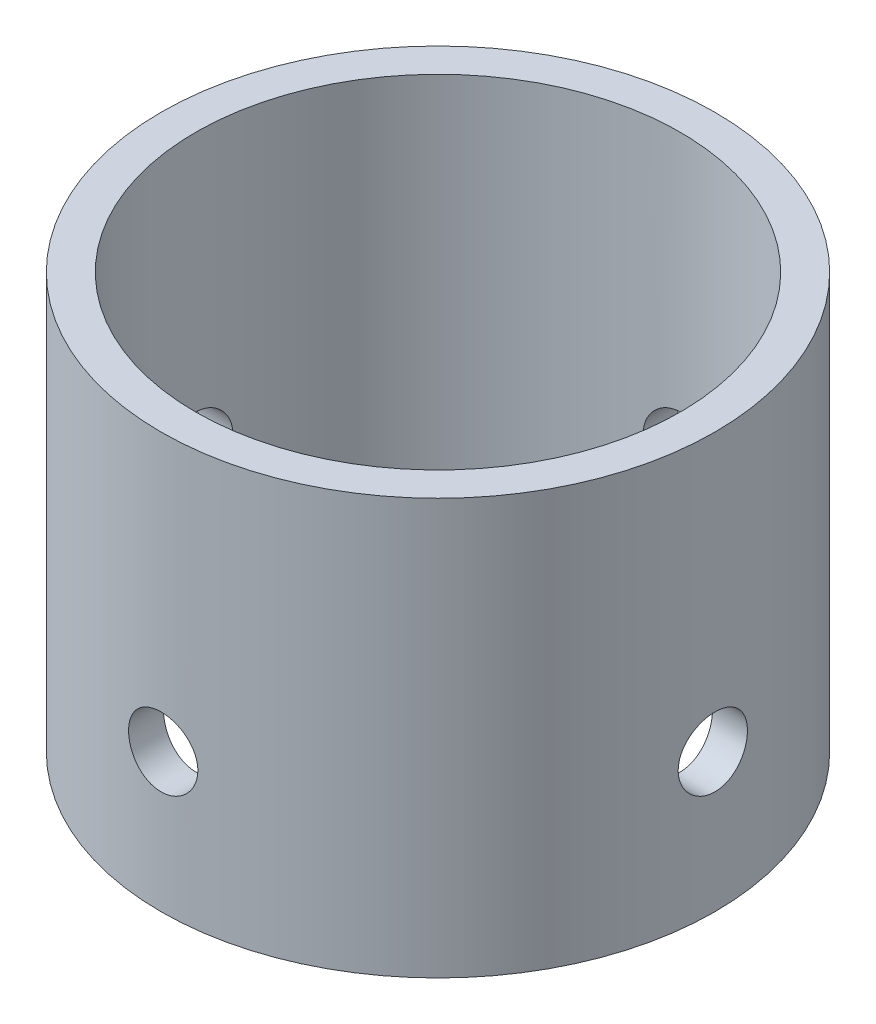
ISO-10303-21;
HEADER;
FILE_DESCRIPTION(('STEP AP214'),'2;1');
FILE_NAME('part.step','',(''),(''),'','','');
FILE_SCHEMA(('AUTOMOTIVE_DESIGN { 1 0 10303 214 1 1 1 1 }'));
ENDSEC;
DATA;
#1=APPLICATION_CONTEXT('core data for automotive mechanical design processes');
#2=APPLICATION_PROTOCOL_DEFINITION('international standard','automotive_design',2000,#1);
#3=PRODUCT_CONTEXT('',#1,'mechanical');
#4=PRODUCT('Part','Part','',(#3));
#5=PRODUCT_RELATED_PRODUCT_CATEGORY('part','',(#4));
#6=PRODUCT_DEFINITION_FORMATION('','',#4);
#7=PRODUCT_DEFINITION_CONTEXT('part definition',#1,'design');
#8=PRODUCT_DEFINITION('design','',#6,#7);
#9=PRODUCT_DEFINITION_SHAPE('','',#8);
#10=(LENGTH_UNIT() NAMED_UNIT(*) SI_UNIT(.MILLI.,.METRE.));
#11=(NAMED_UNIT(*) PLANE_ANGLE_UNIT() SI_UNIT($,.RADIAN.));
#12=(NAMED_UNIT(*) SI_UNIT($,.STERADIAN.) SOLID_ANGLE_UNIT());
#13=UNCERTAINTY_MEASURE_WITH_UNIT(LENGTH_MEASURE(1.E-05),#10,'distance_accuracy_value','');
#14=(GEOMETRIC_REPRESENTATION_CONTEXT(3) GLOBAL_UNCERTAINTY_ASSIGNED_CONTEXT((#13)) GLOBAL_UNIT_ASSIGNED_CONTEXT((#10,
#11,#12)) REPRESENTATION_CONTEXT('',''));
#15=CARTESIAN_POINT('',(0.,0.,0.));
#16=DIRECTION('',(0.,0.,1.));
#17=DIRECTION('',(1.,0.,0.));
#18=AXIS2_PLACEMENT_3D('',#15,#16,#17);
#19=CARTESIAN_POINT('',(0.,19.05,0.));
#20=DIRECTION('',(0.,1.,0.));
#21=DIRECTION('',(0.,0.,1.));
#22=AXIS2_PLACEMENT_3D('',#19,#20,#21);
#23=PLANE('',#22);
#24=CARTESIAN_POINT('',(0.,19.05,0.));
#25=DIRECTION('',(0.,1.,0.));
#26=DIRECTION('',(0.,0.,1.));
#27=AXIS2_PLACEMENT_3D('',#24,#25,#26);
#28=CIRCLE('',#27,12.7);
#29=CARTESIAN_POINT('',(0.,19.05,12.7));
#30=VERTEX_POINT('',#29);
#31=EDGE_CURVE('E10',#30,#30,#28,.T.);
#32=ORIENTED_EDGE('',*,*,#31,.T.);
#33=EDGE_LOOP('',(#32));
#34=FACE_BOUND('',#33,.T.);
#35=CARTESIAN_POINT('',(0.,19.05,0.));
#36=DIRECTION('',(0.,1.,0.));
#37=DIRECTION('',(0.,0.,1.));
#38=AXIS2_PLACEMENT_3D('',#35,#36,#37);
#39=CIRCLE('',#38,11.1125);
#40=CARTESIAN_POINT('',(0.,19.05,11.1125));
#41=VERTEX_POINT('',#40);
#42=EDGE_CURVE('E48',#41,#41,#39,.T.);
#43=ORIENTED_EDGE('',*,*,#42,.F.);
#44=EDGE_LOOP('',(#43));
#45=FACE_BOUND('',#44,.T.);
#46=ADVANCED_FACE('F30',(#34,#45),#23,.T.);
#47=CARTESIAN_POINT('',(0.,0.,0.));
#48=DIRECTION('',(0.,1.,0.));
#49=DIRECTION('',(0.,0.,1.));
#50=AXIS2_PLACEMENT_3D('',#47,#48,#49);
#51=PLANE('',#50);
#52=CARTESIAN_POINT('',(0.,0.,0.));
#53=DIRECTION('',(0.,1.,0.));
#54=DIRECTION('',(0.,0.,1.));
#55=AXIS2_PLACEMENT_3D('',#52,#53,#54);
#56=CIRCLE('',#55,12.7);
#57=CARTESIAN_POINT('',(0.,0.,12.7));
#58=VERTEX_POINT('',#57);
#59=EDGE_CURVE('E43',#58,#58,#56,.T.);
#60=ORIENTED_EDGE('',*,*,#59,.F.);
#61=EDGE_LOOP('',(#60));
#62=FACE_BOUND('',#61,.T.);
#63=CARTESIAN_POINT('',(0.,0.,0.));
#64=DIRECTION('',(0.,1.,0.));
#65=DIRECTION('',(0.,0.,1.));
#66=AXIS2_PLACEMENT_3D('',#63,#64,#65);
#67=CIRCLE('',#66,11.1125);
#68=CARTESIAN_POINT('',(0.,0.,11.1125));
#69=VERTEX_POINT('',#68);
#70=EDGE_CURVE('E51',#69,#69,#67,.T.);
#71=ORIENTED_EDGE('',*,*,#70,.T.);
#72=EDGE_LOOP('',(#71));
#73=FACE_BOUND('',#72,.T.);
#74=ADVANCED_FACE('F98',(#62,#73),#51,.F.);
#75=CARTESIAN_POINT('',(0.,19.05,0.));
#76=DIRECTION('',(0.,-1.,0.));
#77=DIRECTION('',(0.,0.,-1.));
#78=AXIS2_PLACEMENT_3D('',#75,#76,#77);
#79=CYLINDRICAL_SURFACE('',#78,12.7);
#80=CARTESIAN_POINT('',(12.7,4.7625,0.));
#81=CARTESIAN_POINT('',(12.6999987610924,4.76250377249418,0.0887990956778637));
#82=CARTESIAN_POINT('',(12.6990588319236,4.76997577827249,0.177653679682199));
#83=CARTESIAN_POINT('',(12.6953996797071,4.79966512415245,0.352890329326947));
#84=CARTESIAN_POINT('',(12.6926785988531,4.82189786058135,0.439269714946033));
#85=CARTESIAN_POINT('',(12.685763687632,4.88044340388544,0.606993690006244));
#86=CARTESIAN_POINT('',(12.6815708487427,4.91674673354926,0.688341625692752));
#87=CARTESIAN_POINT('',(12.6721787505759,5.00238222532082,0.843774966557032));
#88=CARTESIAN_POINT('',(12.6669796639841,5.051712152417,0.91786161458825));
#89=CARTESIAN_POINT('',(12.6561235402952,5.16229088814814,1.05709263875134));
#90=CARTESIAN_POINT('',(12.6504643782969,5.22359707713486,1.12219128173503));
#91=CARTESIAN_POINT('',(12.6393430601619,5.35626489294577,1.24120452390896));
#92=CARTESIAN_POINT('',(12.6338809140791,5.42762703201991,1.29511855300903));
#93=CARTESIAN_POINT('',(12.6237511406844,5.5786781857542,1.39040245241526));
#94=CARTESIAN_POINT('',(12.6190862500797,5.65839442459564,1.43172948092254));
#95=CARTESIAN_POINT('',(12.6111071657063,5.82370377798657,1.50039265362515));
#96=CARTESIAN_POINT('',(12.6077929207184,5.90929666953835,1.52772932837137));
#97=CARTESIAN_POINT('',(12.6029106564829,6.08345506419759,1.56749685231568));
#98=CARTESIAN_POINT('',(12.6013335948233,6.17200267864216,1.58000491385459));
#99=CARTESIAN_POINT('',(12.6000765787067,6.34995317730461,1.5899990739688));
#100=CARTESIAN_POINT('',(12.6003965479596,6.43935602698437,1.58748577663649));
#101=CARTESIAN_POINT('',(12.6028891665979,6.61594106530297,1.56757194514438));
#102=CARTESIAN_POINT('',(12.6050512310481,6.70313301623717,1.55025646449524));
#103=CARTESIAN_POINT('',(12.6109679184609,6.87336383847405,1.50136249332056));
#104=CARTESIAN_POINT('',(12.6147225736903,6.95640262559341,1.46978371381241));
#105=CARTESIAN_POINT('',(12.6234133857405,7.11623417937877,1.39316813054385));
#106=CARTESIAN_POINT('',(12.6283527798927,7.1930090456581,1.34809436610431));
#107=CARTESIAN_POINT('',(12.6388540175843,7.33793725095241,1.2457947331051));
#108=CARTESIAN_POINT('',(12.644415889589,7.40609019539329,1.18856830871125));
#109=CARTESIAN_POINT('',(12.6555824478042,7.53233362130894,1.06311643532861));
#110=CARTESIAN_POINT('',(12.6611871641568,7.5903512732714,0.994817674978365));
#111=CARTESIAN_POINT('',(12.6717719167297,7.6941101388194,0.849412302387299));
#112=CARTESIAN_POINT('',(12.6767519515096,7.73985132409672,0.772305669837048));
#113=CARTESIAN_POINT('',(12.685529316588,7.81775888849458,0.611417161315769));
#114=CARTESIAN_POINT('',(12.6893262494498,7.84992070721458,0.527633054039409));
#115=CARTESIAN_POINT('',(12.6953059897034,7.89969876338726,0.355795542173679));
#116=CARTESIAN_POINT('',(12.6974888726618,7.91731568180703,0.267742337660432));
#117=CARTESIAN_POINT('',(12.6999847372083,7.93740946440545,0.0904958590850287));
#118=CARTESIAN_POINT('',(12.7003101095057,7.93998665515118,0.00131412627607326));
#119=CARTESIAN_POINT('',(12.6990877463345,7.93019258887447,-0.176209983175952));
#120=CARTESIAN_POINT('',(12.6975400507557,7.91782165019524,-0.264552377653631));
#121=CARTESIAN_POINT('',(12.692753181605,7.87856583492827,-0.437594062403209));
#122=CARTESIAN_POINT('',(12.6895195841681,7.85172879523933,-0.52230437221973));
#123=CARTESIAN_POINT('',(12.6817229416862,7.7843523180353,-0.68602203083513));
#124=CARTESIAN_POINT('',(12.677159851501,7.74381241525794,-0.765029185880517));
#125=CARTESIAN_POINT('',(12.6671820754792,7.64993825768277,-0.915545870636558));
#126=CARTESIAN_POINT('',(12.6617631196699,7.59653910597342,-0.987014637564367));
#127=CARTESIAN_POINT('',(12.6506931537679,7.47855406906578,-1.12001108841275));
#128=CARTESIAN_POINT('',(12.6450421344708,7.41396773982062,-1.18153837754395));
#129=CARTESIAN_POINT('',(12.6341067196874,7.27499979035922,-1.29326129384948));
#130=CARTESIAN_POINT('',(12.6288245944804,7.2005645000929,-1.34339041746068));
#131=CARTESIAN_POINT('',(12.6192623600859,7.04427201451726,-1.43043458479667));
#132=CARTESIAN_POINT('',(12.614982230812,6.96241496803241,-1.46734989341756));
#133=CARTESIAN_POINT('',(12.6079240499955,6.79381717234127,-1.5268108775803));
#134=CARTESIAN_POINT('',(12.6051420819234,6.70708981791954,-1.54939404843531));
#135=CARTESIAN_POINT('',(12.6013839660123,6.53103692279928,-1.57967044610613));
#136=CARTESIAN_POINT('',(12.6004077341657,6.44171150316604,-1.58736436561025));
#137=CARTESIAN_POINT('',(12.6003740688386,6.26365972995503,-1.58763115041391));
#138=CARTESIAN_POINT('',(12.6013033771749,6.17493351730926,-1.58030849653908));
#139=CARTESIAN_POINT('',(12.6049475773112,5.99998347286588,-1.55097124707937));
#140=CARTESIAN_POINT('',(12.6076624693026,5.91375964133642,-1.52895664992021));
#141=CARTESIAN_POINT('',(12.6145678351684,5.74627568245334,-1.47089309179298));
#142=CARTESIAN_POINT('',(12.6187577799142,5.66501378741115,-1.43484916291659));
#143=CARTESIAN_POINT('',(12.6281420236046,5.50967487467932,-1.34976038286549));
#144=CARTESIAN_POINT('',(12.6333363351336,5.43559794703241,-1.30071536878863));
#145=CARTESIAN_POINT('',(12.6441873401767,5.2961976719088,-1.19062902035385));
#146=CARTESIAN_POINT('',(12.6498468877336,5.23093603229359,-1.12950982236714));
#147=CARTESIAN_POINT('',(12.6609654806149,5.11155516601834,-0.997172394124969));
#148=CARTESIAN_POINT('',(12.66642447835,5.05743857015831,-0.925951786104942));
#149=CARTESIAN_POINT('',(12.6765498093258,4.96170879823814,-0.775122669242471));
#150=CARTESIAN_POINT('',(12.6812130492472,4.92014395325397,-0.695483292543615));
#151=CARTESIAN_POINT('',(12.6891900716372,4.85103726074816,-0.53034114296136));
#152=CARTESIAN_POINT('',(12.6925053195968,4.82348017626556,-0.444844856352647));
#153=CARTESIAN_POINT('',(12.6966136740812,4.78976732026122,-0.299088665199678));
#154=CARTESIAN_POINT('',(12.6978773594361,4.77955677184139,-0.23974784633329));
#155=CARTESIAN_POINT('',(12.6995709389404,4.7659218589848,-0.120279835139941));
#156=CARTESIAN_POINT('',(12.7000008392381,4.76249744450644,-0.0601526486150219));
#157=CARTESIAN_POINT('',(12.7,4.7625,0.));
#158=B_SPLINE_CURVE_WITH_KNOTS('',3,(#80,#81,#82,#83,#84,#85,#86,#87,#88,#89,#90,#91,#92,#93,
#94,#95,#96,#97,#98,#99,#100,#101,#102,#103,#104,#105,#106,#107,#108,#109,#110,#111,#112,#113,
#114,#115,#116,#117,#118,#119,#120,#121,#122,#123,#124,#125,#126,#127,#128,#129,#130,#131,#132,
#133,#134,#135,#136,#137,#138,#139,#140,#141,#142,#143,#144,#145,#146,#147,#148,#149,#150,#151,
#152,#153,#154,#155,#156,#157),.UNSPECIFIED.,.T.,.F.,(4,2,2,2,2,2,2,2,2,2,2,2,2,2,2,2,2,2,2,2,2,
2,2,2,2,2,2,2,2,2,2,2,2,2,2,2,2,2,4),(0.,0.266177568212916,0.532633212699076,0.798909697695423,
1.06514052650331,1.3326796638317,1.60023243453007,1.86868593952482,2.13712926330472,
2.40416858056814,2.67119715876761,2.93670162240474,3.20221146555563,3.46845525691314,
3.7347112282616,4.00280808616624,4.27090556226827,4.53909300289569,4.807267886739,
5.0736517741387,5.34002998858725,5.60553269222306,5.87104441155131,6.13792525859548,
6.40481670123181,6.67322751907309,6.94163295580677,7.20933327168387,7.47702113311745,
7.74285282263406,8.00868454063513,8.27442099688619,8.54016078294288,8.80767375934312,
9.07524981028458,9.34384340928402,9.61214421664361,9.79245465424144,9.97276376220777),.UNSPECIFIED.);
#159=CARTESIAN_POINT('',(12.7,4.7625,0.));
#160=VERTEX_POINT('',#159);
#161=EDGE_CURVE('E61',#160,#160,#158,.T.);
#162=ORIENTED_EDGE('',*,*,#161,.T.);
#163=EDGE_LOOP('',(#162));
#164=FACE_BOUND('',#163,.T.);
#165=CARTESIAN_POINT('',(-12.6003906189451,6.35,1.58750000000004));
#166=CARTESIAN_POINT('',(-12.6003918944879,6.26120395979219,1.5874962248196));
#167=CARTESIAN_POINT('',(-12.6013393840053,6.17235242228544,1.58002471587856));
#168=CARTESIAN_POINT('',(-12.6050255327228,5.99712210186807,1.5503375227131));
#169=CARTESIAN_POINT('',(-12.6077660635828,5.91074600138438,1.52810643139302));
#170=CARTESIAN_POINT('',(-12.614723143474,5.74302897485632,1.46956569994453));
#171=CARTESIAN_POINT('',(-12.6189386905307,5.66168467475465,1.43326561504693));
#172=CARTESIAN_POINT('',(-12.6283696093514,5.50625743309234,1.3476377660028));
#173=CARTESIAN_POINT('',(-12.6335848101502,5.43217325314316,1.29831222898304));
#174=CARTESIAN_POINT('',(-12.6444601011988,5.29293947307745,1.18773794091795));
#175=CARTESIAN_POINT('',(-12.650122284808,5.22783638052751,1.12643082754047));
#176=CARTESIAN_POINT('',(-12.6612347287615,5.10881454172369,0.993759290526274));
#177=CARTESIAN_POINT('',(-12.6666849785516,5.05489635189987,0.922394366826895));
#178=CARTESIAN_POINT('',(-12.6767808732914,4.95960807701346,0.771340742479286));
#179=CARTESIAN_POINT('',(-12.6814237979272,4.91828007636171,0.691625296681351));
#180=CARTESIAN_POINT('',(-12.6893589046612,4.84961488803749,0.526317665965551));
#181=CARTESIAN_POINT('',(-12.6926511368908,4.82227718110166,0.440725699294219));
#182=CARTESIAN_POINT('',(-12.6974991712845,4.78250753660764,0.266570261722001));
#183=CARTESIAN_POINT('',(-12.6990639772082,4.76999828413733,0.17802470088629));
#184=CARTESIAN_POINT('',(-12.7003115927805,4.7600010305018,7.82324360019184E-05));
#185=CARTESIAN_POINT('',(-12.6999944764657,4.76251243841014,-0.0893226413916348));
#186=CARTESIAN_POINT('',(-12.6975212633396,4.78242325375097,-0.265915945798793));
#187=CARTESIAN_POINT('',(-12.6953754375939,4.79973951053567,-0.353117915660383));
#188=CARTESIAN_POINT('',(-12.6894974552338,4.84863849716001,-0.523368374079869));
#189=CARTESIAN_POINT('',(-12.6857652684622,4.88022149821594,-0.606416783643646));
#190=CARTESIAN_POINT('',(-12.6771162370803,4.9568458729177,-0.766260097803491));
#191=CARTESIAN_POINT('',(-12.6721962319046,5.00192323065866,-0.843037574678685));
#192=CARTESIAN_POINT('',(-12.6617220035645,5.10423056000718,-0.987969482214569));
#193=CARTESIAN_POINT('',(-12.6561677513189,5.16146108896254,-1.05612351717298));
#194=CARTESIAN_POINT('',(-12.6450018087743,5.28691590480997,-1.18236239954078));
#195=CARTESIAN_POINT('',(-12.63938998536,5.35521265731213,-1.24037524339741));
#196=CARTESIAN_POINT('',(-12.6287788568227,5.50061228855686,-1.3441253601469));
#197=CARTESIAN_POINT('',(-12.6237795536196,5.57771519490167,-1.38986259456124));
#198=CARTESIAN_POINT('',(-12.6149595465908,5.73860262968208,-1.46776730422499));
#199=CARTESIAN_POINT('',(-12.6111393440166,5.82238998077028,-1.49992901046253));
#200=CARTESIAN_POINT('',(-12.6051198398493,5.99423455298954,-1.54970585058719));
#201=CARTESIAN_POINT('',(-12.6029204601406,6.08229156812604,-1.56732168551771));
#202=CARTESIAN_POINT('',(-12.6004058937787,6.25953992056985,-1.58741137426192));
#203=CARTESIAN_POINT('',(-12.6000780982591,6.34871960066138,-1.58998655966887));
#204=CARTESIAN_POINT('',(-12.6013104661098,6.52623912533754,-1.58018921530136));
#205=CARTESIAN_POINT('',(-12.6028705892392,6.61457898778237,-1.56781700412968));
#206=CARTESIAN_POINT('',(-12.6076915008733,6.78760755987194,-1.52856138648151));
#207=CARTESIAN_POINT('',(-12.6109465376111,6.87230757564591,-1.5017270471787));
#208=CARTESIAN_POINT('',(-12.6187858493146,7.03600583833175,-1.4343594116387));
#209=CARTESIAN_POINT('',(-12.6233701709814,7.11500388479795,-1.39382563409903));
#210=CARTESIAN_POINT('',(-12.633381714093,7.26551419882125,-1.29996058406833));
#211=CARTESIAN_POINT('',(-12.6388132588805,7.33698473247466,-1.24656286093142));
#212=CARTESIAN_POINT('',(-12.649893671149,7.46998541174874,-1.12857962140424));
#213=CARTESIAN_POINT('',(-12.6555425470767,7.53151517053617,-1.06399366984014));
#214=CARTESIAN_POINT('',(-12.6664598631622,7.64324365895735,-0.925024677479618));
#215=CARTESIAN_POINT('',(-12.6717259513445,7.69337580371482,-0.850587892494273));
#216=CARTESIAN_POINT('',(-12.6812491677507,7.78042526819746,-0.694291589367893));
#217=CARTESIAN_POINT('',(-12.685506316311,7.81734285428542,-0.612432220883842));
#218=CARTESIAN_POINT('',(-12.6925215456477,7.8768052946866,-0.44383570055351));
#219=CARTESIAN_POINT('',(-12.6952836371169,7.89938863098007,-0.357112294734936));
#220=CARTESIAN_POINT('',(-12.6990141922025,7.92966669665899,-0.181067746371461));
#221=CARTESIAN_POINT('',(-12.6999827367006,7.93736209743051,-0.0917467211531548));
#222=CARTESIAN_POINT('',(-12.7000166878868,7.93763330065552,0.0863074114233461));
#223=CARTESIAN_POINT('',(-12.6990950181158,7.93031177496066,0.1750403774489));
#224=CARTESIAN_POINT('',(-12.6954777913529,7.90097441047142,0.350004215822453));
#225=CARTESIAN_POINT('',(-12.6927822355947,7.87895858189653,0.436235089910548));
#226=CARTESIAN_POINT('',(-12.6859187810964,7.82088979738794,0.603733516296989));
#227=CARTESIAN_POINT('',(-12.6817513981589,7.784841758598,0.685002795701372));
#228=CARTESIAN_POINT('',(-12.6724057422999,7.6997424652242,0.840354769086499));
#229=CARTESIAN_POINT('',(-12.6672274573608,7.65069105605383,0.914437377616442));
#230=CARTESIAN_POINT('',(-12.6563957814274,7.5405975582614,1.05383759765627));
#231=CARTESIAN_POINT('',(-12.6507395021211,7.47947907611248,1.11909465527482));
#232=CARTESIAN_POINT('',(-12.639612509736,7.34714498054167,1.23846661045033));
#233=CARTESIAN_POINT('',(-12.6341418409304,7.27592697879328,1.29257886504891));
#234=CARTESIAN_POINT('',(-12.6239829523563,7.12510009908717,1.38830382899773));
#235=CARTESIAN_POINT('',(-12.619297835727,7.04545988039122,1.42986746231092));
#236=CARTESIAN_POINT('',(-12.6112768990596,6.88031596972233,1.49897165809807));
#237=CARTESIAN_POINT('',(-12.6079396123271,6.79481877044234,1.52652747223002));
#238=CARTESIAN_POINT('',(-12.603802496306,6.64906595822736,1.56023684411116));
#239=CARTESIAN_POINT('',(-12.6025294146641,6.58972967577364,1.57044582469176));
#240=CARTESIAN_POINT('',(-12.6008230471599,6.470270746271,1.58407865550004));
#241=CARTESIAN_POINT('',(-12.6003897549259,6.41014810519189,1.58750255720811));
#242=CARTESIAN_POINT('',(-12.6003906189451,6.35,1.58750000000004));
#243=B_SPLINE_CURVE_WITH_KNOTS('',3,(#165,#166,#167,#168,#169,#170,#171,#172,#173,#174,#175,
#176,#177,#178,#179,#180,#181,#182,#183,#184,#185,#186,#187,#188,#189,#190,#191,#192,#193,#194,
#195,#196,#197,#198,#199,#200,#201,#202,#203,#204,#205,#206,#207,#208,#209,#210,#211,#212,#213,
#214,#215,#216,#217,#218,#219,#220,#221,#222,#223,#224,#225,#226,#227,#228,#229,#230,#231,#232,
#233,#234,#235,#236,#237,#238,#239,#240,#241,#242),.UNSPECIFIED.,.T.,.F.,(4,2,2,2,2,2,2,2,2,2,2,
2,2,2,2,2,2,2,2,2,2,2,2,2,2,2,2,2,2,2,2,2,2,2,2,2,2,2,4),(0.,0.266168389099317,
0.532615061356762,0.798881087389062,1.06510161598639,1.33265276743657,1.60021722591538,
1.86866648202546,2.13710577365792,2.40413919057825,2.67116210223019,2.93669507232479,
3.20223309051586,3.46848559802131,3.73475031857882,4.00283487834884,4.27092027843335,
4.53911948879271,4.8073057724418,5.07368313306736,5.34005481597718,5.60552838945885,
5.87101129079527,6.13789615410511,6.40479140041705,6.67320792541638,6.94161903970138,
7.20930649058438,7.47698186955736,7.74283323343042,8.00868441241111,8.27444251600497,
8.54020377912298,8.80770481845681,9.07526922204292,9.3438668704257,9.6121714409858,
9.79246828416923,9.97276375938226),.UNSPECIFIED.);
#244=CARTESIAN_POINT('',(-12.6003906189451,6.35,1.58750000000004));
#245=VERTEX_POINT('',#244);
#246=EDGE_CURVE('E157',#245,#245,#243,.T.);
#247=ORIENTED_EDGE('',*,*,#246,.T.);
#248=EDGE_LOOP('',(#247));
#249=FACE_BOUND('',#248,.T.);
#250=CARTESIAN_POINT('',(0.,4.7625,12.7));
#251=CARTESIAN_POINT('',(-0.0887990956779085,4.76250377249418,12.6999987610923));
#252=CARTESIAN_POINT('',(-0.177653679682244,4.76997577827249,12.6990588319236));
#253=CARTESIAN_POINT('',(-0.352890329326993,4.79966512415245,12.6953996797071));
#254=CARTESIAN_POINT('',(-0.439269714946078,4.82189786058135,12.6926785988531));
#255=CARTESIAN_POINT('',(-0.606993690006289,4.88044340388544,12.685763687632));
#256=CARTESIAN_POINT('',(-0.688341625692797,4.91674673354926,12.6815708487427));
#257=CARTESIAN_POINT('',(-0.843774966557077,5.00238222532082,12.6721787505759));
#258=CARTESIAN_POINT('',(-0.917861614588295,5.051712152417,12.6669796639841));
#259=CARTESIAN_POINT('',(-1.05709263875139,5.16229088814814,12.6561235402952));
#260=CARTESIAN_POINT('',(-1.12219128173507,5.22359707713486,12.6504643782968));
#261=CARTESIAN_POINT('',(-1.24120452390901,5.35626489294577,12.6393430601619));
#262=CARTESIAN_POINT('',(-1.29511855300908,5.42762703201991,12.6338809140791));
#263=CARTESIAN_POINT('',(-1.3904024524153,5.5786781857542,12.6237511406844));
#264=CARTESIAN_POINT('',(-1.43172948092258,5.65839442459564,12.6190862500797));
#265=CARTESIAN_POINT('',(-1.5003926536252,5.82370377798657,12.6111071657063));
#266=CARTESIAN_POINT('',(-1.52772932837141,5.90929666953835,12.6077929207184));
#267=CARTESIAN_POINT('',(-1.56749685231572,6.0834550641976,12.6029106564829));
#268=CARTESIAN_POINT('',(-1.58000491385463,6.17200267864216,12.6013335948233));
#269=CARTESIAN_POINT('',(-1.58999907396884,6.34995317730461,12.6000765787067));
#270=CARTESIAN_POINT('',(-1.58748577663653,6.43935602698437,12.6003965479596));
#271=CARTESIAN_POINT('',(-1.56757194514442,6.61594106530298,12.6028891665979));
#272=CARTESIAN_POINT('',(-1.55025646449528,6.70313301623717,12.6050512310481));
#273=CARTESIAN_POINT('',(-1.5013624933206,6.87336383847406,12.6109679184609));
#274=CARTESIAN_POINT('',(-1.46978371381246,6.95640262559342,12.6147225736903));
#275=CARTESIAN_POINT('',(-1.3931681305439,7.11623417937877,12.6234133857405));
#276=CARTESIAN_POINT('',(-1.34809436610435,7.1930090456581,12.6283527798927));
#277=CARTESIAN_POINT('',(-1.24579473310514,7.33793725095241,12.6388540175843));
#278=CARTESIAN_POINT('',(-1.18856830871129,7.40609019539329,12.644415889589));
#279=CARTESIAN_POINT('',(-1.06311643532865,7.53233362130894,12.6555824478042));
#280=CARTESIAN_POINT('',(-0.994817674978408,7.5903512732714,12.6611871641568));
#281=CARTESIAN_POINT('',(-0.849412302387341,7.6941101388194,12.6717719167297));
#282=CARTESIAN_POINT('',(-0.77230566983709,7.73985132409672,12.6767519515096));
#283=CARTESIAN_POINT('',(-0.61141716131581,7.81775888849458,12.685529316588));
#284=CARTESIAN_POINT('',(-0.52763305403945,7.84992070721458,12.6893262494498));
#285=CARTESIAN_POINT('',(-0.355795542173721,7.89969876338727,12.6953059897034));
#286=CARTESIAN_POINT('',(-0.267742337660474,7.91731568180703,12.6974888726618));
#287=CARTESIAN_POINT('',(-0.0904958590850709,7.93740946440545,12.6999847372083));
#288=CARTESIAN_POINT('',(-0.00131412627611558,7.93998665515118,12.7003101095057));
#289=CARTESIAN_POINT('',(0.17620998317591,7.93019258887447,12.6990877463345));
#290=CARTESIAN_POINT('',(0.264552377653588,7.91782165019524,12.6975400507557));
#291=CARTESIAN_POINT('',(0.437594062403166,7.87856583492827,12.692753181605));
#292=CARTESIAN_POINT('',(0.522304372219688,7.85172879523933,12.6895195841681));
#293=CARTESIAN_POINT('',(0.686022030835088,7.7843523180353,12.6817229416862));
#294=CARTESIAN_POINT('',(0.765029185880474,7.74381241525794,12.677159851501));
#295=CARTESIAN_POINT('',(0.915545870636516,7.64993825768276,12.6671820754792));
#296=CARTESIAN_POINT('',(0.987014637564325,7.59653910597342,12.6617631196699));
#297=CARTESIAN_POINT('',(1.12001108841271,7.47855406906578,12.6506931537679));
#298=CARTESIAN_POINT('',(1.1815383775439,7.41396773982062,12.6450421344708));
#299=CARTESIAN_POINT('',(1.29326129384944,7.27499979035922,12.6341067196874));
#300=CARTESIAN_POINT('',(1.34339041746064,7.2005645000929,12.6288245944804));
#301=CARTESIAN_POINT('',(1.43043458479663,7.04427201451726,12.6192623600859));
#302=CARTESIAN_POINT('',(1.46734989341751,6.96241496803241,12.614982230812));
#303=CARTESIAN_POINT('',(1.52681087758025,6.79381717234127,12.6079240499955));
#304=CARTESIAN_POINT('',(1.54939404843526,6.70708981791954,12.6051420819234));
#305=CARTESIAN_POINT('',(1.57967044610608,6.53103692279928,12.6013839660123));
#306=CARTESIAN_POINT('',(1.58736436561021,6.44171150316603,12.6004077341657));
#307=CARTESIAN_POINT('',(1.58763115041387,6.26365972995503,12.6003740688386));
#308=CARTESIAN_POINT('',(1.58030849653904,6.17493351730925,12.6013033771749));
#309=CARTESIAN_POINT('',(1.55097124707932,5.99998347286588,12.6049475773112));
#310=CARTESIAN_POINT('',(1.52895664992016,5.91375964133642,12.6076624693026));
#311=CARTESIAN_POINT('',(1.47089309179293,5.74627568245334,12.6145678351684));
#312=CARTESIAN_POINT('',(1.43484916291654,5.66501378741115,12.6187577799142));
#313=CARTESIAN_POINT('',(1.34976038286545,5.50967487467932,12.6281420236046));
#314=CARTESIAN_POINT('',(1.30071536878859,5.43559794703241,12.6333363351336));
#315=CARTESIAN_POINT('',(1.19062902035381,5.2961976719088,12.6441873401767));
#316=CARTESIAN_POINT('',(1.1295098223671,5.23093603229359,12.6498468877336));
#317=CARTESIAN_POINT('',(0.997172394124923,5.11155516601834,12.6609654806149));
#318=CARTESIAN_POINT('',(0.925951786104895,5.05743857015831,12.66642447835));
#319=CARTESIAN_POINT('',(0.775122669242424,4.96170879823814,12.6765498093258));
#320=CARTESIAN_POINT('',(0.695483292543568,4.92014395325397,12.6812130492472));
#321=CARTESIAN_POINT('',(0.530341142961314,4.85103726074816,12.6891900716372));
#322=CARTESIAN_POINT('',(0.444844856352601,4.82348017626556,12.6925053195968));
#323=CARTESIAN_POINT('',(0.299088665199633,4.78976732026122,12.6966136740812));
#324=CARTESIAN_POINT('',(0.239747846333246,4.77955677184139,12.6978773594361));
#325=CARTESIAN_POINT('',(0.120279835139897,4.7659218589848,12.6995709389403));
#326=CARTESIAN_POINT('',(0.0601526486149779,4.76249744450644,12.700000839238));
#327=CARTESIAN_POINT('',(0.,4.7625,12.7));
#328=B_SPLINE_CURVE_WITH_KNOTS('',3,(#250,#251,#252,#253,#254,#255,#256,#257,#258,#259,#260,
#261,#262,#263,#264,#265,#266,#267,#268,#269,#270,#271,#272,#273,#274,#275,#276,#277,#278,#279,
#280,#281,#282,#283,#284,#285,#286,#287,#288,#289,#290,#291,#292,#293,#294,#295,#296,#297,#298,
#299,#300,#301,#302,#303,#304,#305,#306,#307,#308,#309,#310,#311,#312,#313,#314,#315,#316,#317,
#318,#319,#320,#321,#322,#323,#324,#325,#326,#327),.UNSPECIFIED.,.T.,.F.,(4,2,2,2,2,2,2,2,2,2,2,
2,2,2,2,2,2,2,2,2,2,2,2,2,2,2,2,2,2,2,2,2,2,2,2,2,2,2,4),(0.,0.266177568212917,
0.532633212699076,0.798909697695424,1.06514052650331,1.3326796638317,1.60023243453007,
1.86868593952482,2.13712926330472,2.40416858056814,2.67119715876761,2.93670162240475,
3.20221146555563,3.46845525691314,3.7347112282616,4.00280808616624,4.27090556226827,
4.53909300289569,4.807267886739,5.0736517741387,5.34002998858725,5.60553269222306,
5.87104441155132,6.13792525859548,6.40481670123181,6.67322751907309,6.94163295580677,
7.20933327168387,7.47702113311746,7.74285282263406,8.00868454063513,8.2744209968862,
8.54016078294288,8.80767375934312,9.07524981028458,9.34384340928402,9.61214421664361,
9.79245465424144,9.97276376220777),.UNSPECIFIED.);
#329=CARTESIAN_POINT('',(0.,4.7625,12.7));
#330=VERTEX_POINT('',#329);
#331=EDGE_CURVE('E80',#330,#330,#328,.T.);
#332=ORIENTED_EDGE('',*,*,#331,.T.);
#333=EDGE_LOOP('',(#332));
#334=FACE_BOUND('',#333,.T.);
#335=CARTESIAN_POINT('',(0.,7.9375,-12.7));
#336=CARTESIAN_POINT('',(-0.0887990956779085,7.93749622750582,-12.6999987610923));
#337=CARTESIAN_POINT('',(-0.177653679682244,7.93002422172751,-12.6990588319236));
#338=CARTESIAN_POINT('',(-0.352890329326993,7.90033487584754,-12.6953996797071));
#339=CARTESIAN_POINT('',(-0.439269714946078,7.87810213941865,-12.6926785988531));
#340=CARTESIAN_POINT('',(-0.606993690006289,7.81955659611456,-12.685763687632));
#341=CARTESIAN_POINT('',(-0.688341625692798,7.78325326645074,-12.6815708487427));
#342=CARTESIAN_POINT('',(-0.843774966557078,7.69761777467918,-12.6721787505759));
#343=CARTESIAN_POINT('',(-0.917861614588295,7.648287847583,-12.6669796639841));
#344=CARTESIAN_POINT('',(-1.05709263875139,7.53770911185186,-12.6561235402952));
#345=CARTESIAN_POINT('',(-1.12219128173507,7.47640292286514,-12.6504643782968));
#346=CARTESIAN_POINT('',(-1.24120452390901,7.34373510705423,-12.6393430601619));
#347=CARTESIAN_POINT('',(-1.29511855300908,7.27237296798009,-12.6338809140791));
#348=CARTESIAN_POINT('',(-1.3904024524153,7.1213218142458,-12.6237511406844));
#349=CARTESIAN_POINT('',(-1.43172948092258,7.04160557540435,-12.6190862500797));
#350=CARTESIAN_POINT('',(-1.5003926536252,6.87629622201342,-12.6111071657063));
#351=CARTESIAN_POINT('',(-1.52772932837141,6.79070333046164,-12.6077929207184));
#352=CARTESIAN_POINT('',(-1.56749685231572,6.6165449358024,-12.6029106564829));
#353=CARTESIAN_POINT('',(-1.58000491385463,6.52799732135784,-12.6013335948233));
#354=CARTESIAN_POINT('',(-1.58999907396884,6.35004682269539,-12.6000765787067));
#355=CARTESIAN_POINT('',(-1.58748577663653,6.26064397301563,-12.6003965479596));
#356=CARTESIAN_POINT('',(-1.56757194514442,6.08405893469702,-12.6028891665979));
#357=CARTESIAN_POINT('',(-1.55025646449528,5.99686698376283,-12.6050512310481));
#358=CARTESIAN_POINT('',(-1.5013624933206,5.82663616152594,-12.6109679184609));
#359=CARTESIAN_POINT('',(-1.46978371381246,5.74359737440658,-12.6147225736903));
#360=CARTESIAN_POINT('',(-1.3931681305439,5.58376582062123,-12.6234133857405));
#361=CARTESIAN_POINT('',(-1.34809436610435,5.50699095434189,-12.6283527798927));
#362=CARTESIAN_POINT('',(-1.24579473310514,5.36206274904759,-12.6388540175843));
#363=CARTESIAN_POINT('',(-1.18856830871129,5.29390980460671,-12.644415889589));
#364=CARTESIAN_POINT('',(-1.06311643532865,5.16766637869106,-12.6555824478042));
#365=CARTESIAN_POINT('',(-0.994817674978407,5.1096487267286,-12.6611871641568));
#366=CARTESIAN_POINT('',(-0.84941230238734,5.0058898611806,-12.6717719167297));
#367=CARTESIAN_POINT('',(-0.772305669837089,4.96014867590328,-12.6767519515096));
#368=CARTESIAN_POINT('',(-0.611417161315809,4.88224111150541,-12.685529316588));
#369=CARTESIAN_POINT('',(-0.527633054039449,4.85007929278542,-12.6893262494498));
#370=CARTESIAN_POINT('',(-0.355795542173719,4.80030123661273,-12.6953059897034));
#371=CARTESIAN_POINT('',(-0.267742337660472,4.78268431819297,-12.6974888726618));
#372=CARTESIAN_POINT('',(-0.0904958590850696,4.76259053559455,-12.6999847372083));
#373=CARTESIAN_POINT('',(-0.00131412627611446,4.76001334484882,-12.7003101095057));
#374=CARTESIAN_POINT('',(0.176209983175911,4.76980741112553,-12.6990877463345));
#375=CARTESIAN_POINT('',(0.264552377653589,4.78217834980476,-12.6975400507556));
#376=CARTESIAN_POINT('',(0.437594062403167,4.82143416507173,-12.692753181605));
#377=CARTESIAN_POINT('',(0.522304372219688,4.84827120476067,-12.6895195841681));
#378=CARTESIAN_POINT('',(0.686022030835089,4.9156476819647,-12.6817229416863));
#379=CARTESIAN_POINT('',(0.765029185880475,4.95618758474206,-12.677159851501));
#380=CARTESIAN_POINT('',(0.915545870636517,5.05006174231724,-12.6671820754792));
#381=CARTESIAN_POINT('',(0.987014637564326,5.10346089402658,-12.6617631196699));
#382=CARTESIAN_POINT('',(1.12001108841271,5.22144593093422,-12.6506931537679));
#383=CARTESIAN_POINT('',(1.1815383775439,5.28603226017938,-12.6450421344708));
#384=CARTESIAN_POINT('',(1.29326129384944,5.42500020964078,-12.6341067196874));
#385=CARTESIAN_POINT('',(1.34339041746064,5.4994354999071,-12.6288245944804));
#386=CARTESIAN_POINT('',(1.43043458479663,5.65572798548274,-12.6192623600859));
#387=CARTESIAN_POINT('',(1.46734989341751,5.73758503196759,-12.614982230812));
#388=CARTESIAN_POINT('',(1.52681087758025,5.90618282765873,-12.6079240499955));
#389=CARTESIAN_POINT('',(1.54939404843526,5.99291018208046,-12.6051420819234));
#390=CARTESIAN_POINT('',(1.57967044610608,6.16896307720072,-12.6013839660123));
#391=CARTESIAN_POINT('',(1.58736436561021,6.25828849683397,-12.6004077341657));
#392=CARTESIAN_POINT('',(1.58763115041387,6.43634027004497,-12.6003740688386));
#393=CARTESIAN_POINT('',(1.58030849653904,6.52506648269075,-12.6013033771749));
#394=CARTESIAN_POINT('',(1.55097124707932,6.70001652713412,-12.6049475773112));
#395=CARTESIAN_POINT('',(1.52895664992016,6.78624035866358,-12.6076624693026));
#396=CARTESIAN_POINT('',(1.47089309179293,6.95372431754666,-12.6145678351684));
#397=CARTESIAN_POINT('',(1.43484916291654,7.03498621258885,-12.6187577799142));
#398=CARTESIAN_POINT('',(1.34976038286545,7.19032512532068,-12.6281420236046));
#399=CARTESIAN_POINT('',(1.30071536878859,7.26440205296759,-12.6333363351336));
#400=CARTESIAN_POINT('',(1.19062902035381,7.4038023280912,-12.6441873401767));
#401=CARTESIAN_POINT('',(1.1295098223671,7.46906396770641,-12.6498468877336));
#402=CARTESIAN_POINT('',(0.997172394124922,7.58844483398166,-12.6609654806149));
#403=CARTESIAN_POINT('',(0.925951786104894,7.64256142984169,-12.66642447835));
#404=CARTESIAN_POINT('',(0.775122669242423,7.73829120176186,-12.6765498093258));
#405=CARTESIAN_POINT('',(0.695483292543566,7.77985604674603,-12.6812130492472));
#406=CARTESIAN_POINT('',(0.530341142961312,7.84896273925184,-12.6891900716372));
#407=CARTESIAN_POINT('',(0.444844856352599,7.87651982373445,-12.6925053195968));
#408=CARTESIAN_POINT('',(0.299088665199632,7.91023267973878,-12.6966136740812));
#409=CARTESIAN_POINT('',(0.239747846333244,7.92044322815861,-12.6978773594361));
#410=CARTESIAN_POINT('',(0.120279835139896,7.9340781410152,-12.6995709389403));
#411=CARTESIAN_POINT('',(0.0601526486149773,7.93750255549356,-12.700000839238));
#412=CARTESIAN_POINT('',(0.,7.9375,-12.7));
#413=B_SPLINE_CURVE_WITH_KNOTS('',3,(#335,#336,#337,#338,#339,#340,#341,#342,#343,#344,#345,
#346,#347,#348,#349,#350,#351,#352,#353,#354,#355,#356,#357,#358,#359,#360,#361,#362,#363,#364,
#365,#366,#367,#368,#369,#370,#371,#372,#373,#374,#375,#376,#377,#378,#379,#380,#381,#382,#383,
#384,#385,#386,#387,#388,#389,#390,#391,#392,#393,#394,#395,#396,#397,#398,#399,#400,#401,#402,
#403,#404,#405,#406,#407,#408,#409,#410,#411,#412),.UNSPECIFIED.,.T.,.F.,(4,2,2,2,2,2,2,2,2,2,2,
2,2,2,2,2,2,2,2,2,2,2,2,2,2,2,2,2,2,2,2,2,2,2,2,2,2,2,4),(0.,0.266177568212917,
0.532633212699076,0.798909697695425,1.06514052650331,1.3326796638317,1.60023243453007,
1.86868593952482,2.13712926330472,2.40416858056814,2.67119715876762,2.93670162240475,
3.20221146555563,3.46845525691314,3.73471122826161,4.00280808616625,4.27090556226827,
4.53909300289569,4.80726788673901,5.0736517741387,5.34002998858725,5.60553269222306,
5.87104441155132,6.13792525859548,6.40481670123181,6.67322751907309,6.94163295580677,
7.20933327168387,7.47702113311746,7.74285282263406,8.00868454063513,8.2744209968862,
8.54016078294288,8.80767375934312,9.07524981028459,9.34384340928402,9.61214421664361,
9.79245465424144,9.97276376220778),.UNSPECIFIED.);
#414=CARTESIAN_POINT('',(0.,7.9375,-12.7));
#415=VERTEX_POINT('',#414);
#416=EDGE_CURVE('E85',#415,#415,#413,.T.);
#417=ORIENTED_EDGE('',*,*,#416,.T.);
#418=EDGE_LOOP('',(#417));
#419=FACE_BOUND('',#418,.T.);
#420=ORIENTED_EDGE('',*,*,#31,.F.);
#421=EDGE_LOOP('',(#420));
#422=FACE_BOUND('',#421,.T.);
#423=ORIENTED_EDGE('',*,*,#59,.T.);
#424=EDGE_LOOP('',(#423));
#425=FACE_BOUND('',#424,.T.);
#426=ADVANCED_FACE('F32',(#164,#249,#334,#419,#422,#425),#79,.T.);
#427=CARTESIAN_POINT('',(0.,19.05,0.));
#428=DIRECTION('',(0.,-1.,0.));
#429=DIRECTION('',(0.,0.,-1.));
#430=AXIS2_PLACEMENT_3D('',#427,#428,#429);
#431=CYLINDRICAL_SURFACE('',#430,11.1125);
#432=CARTESIAN_POINT('',(10.9985226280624,6.35,1.58749999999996));
#433=CARTESIAN_POINT('',(10.9985240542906,6.43868106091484,1.58749630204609));
#434=CARTESIAN_POINT('',(10.9996067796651,6.52741480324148,1.58004402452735));
#435=CARTESIAN_POINT('',(11.0038181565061,6.70240486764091,1.55043774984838));
#436=CARTESIAN_POINT('',(11.0069488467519,6.78865863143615,1.52826910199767));
#437=CARTESIAN_POINT('',(11.0148944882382,6.95613028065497,1.46990386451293));
#438=CARTESIAN_POINT('',(11.0197081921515,7.03735184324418,1.43371766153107));
#439=CARTESIAN_POINT('',(11.0304759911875,7.19255747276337,1.34836833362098));
#440=CARTESIAN_POINT('',(11.0364299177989,7.26654260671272,1.29920712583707));
#441=CARTESIAN_POINT('',(11.0488557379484,7.40572583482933,1.18892119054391));
#442=CARTESIAN_POINT('',(11.0553307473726,7.47086367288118,1.12772076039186));
#443=CARTESIAN_POINT('',(11.0680412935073,7.58998161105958,0.995256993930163));
#444=CARTESIAN_POINT('',(11.0742768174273,7.64396111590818,0.923993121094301));
#445=CARTESIAN_POINT('',(11.0858382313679,7.73945072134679,0.773041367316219));
#446=CARTESIAN_POINT('',(11.0911600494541,7.78090559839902,0.693318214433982));
#447=CARTESIAN_POINT('',(11.1002599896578,7.84981502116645,0.527952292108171));
#448=CARTESIAN_POINT('',(11.1040381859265,7.87727023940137,0.44230980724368));
#449=CARTESIAN_POINT('',(11.1096032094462,7.91721905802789,0.26815578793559));
#450=CARTESIAN_POINT('',(11.1114034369,7.9298133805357,0.179667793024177));
#451=CARTESIAN_POINT('',(11.1128555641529,7.93999546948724,0.00181734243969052));
#452=CARTESIAN_POINT('',(11.1125075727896,7.9375839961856,-0.0875450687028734));
#453=CARTESIAN_POINT('',(11.1097132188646,7.9179028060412,-0.263921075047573));
#454=CARTESIAN_POINT('',(11.1072821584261,7.90074143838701,-0.350947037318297));
#455=CARTESIAN_POINT('',(11.1006118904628,7.85221746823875,-0.520871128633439));
#456=CARTESIAN_POINT('',(11.0963726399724,7.82085452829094,-0.603769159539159));
#457=CARTESIAN_POINT('',(11.0865359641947,7.74470547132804,-0.76341443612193));
#458=CARTESIAN_POINT('',(11.080933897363,7.69987335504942,-0.840139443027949));
#459=CARTESIAN_POINT('',(11.0689966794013,7.59809210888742,-0.985018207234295));
#460=CARTESIAN_POINT('',(11.0626614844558,7.54114225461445,-1.05317145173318));
#461=CARTESIAN_POINT('',(11.0498985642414,7.41613753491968,-1.17961012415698));
#462=CARTESIAN_POINT('',(11.0434705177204,7.34798811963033,-1.23780208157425));
#463=CARTESIAN_POINT('',(11.0313017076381,7.20284109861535,-1.34193747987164));
#464=CARTESIAN_POINT('',(11.0255609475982,7.12584344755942,-1.3878808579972));
#465=CARTESIAN_POINT('',(11.0154168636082,6.96509251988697,-1.46622533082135));
#466=CARTESIAN_POINT('',(11.0110144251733,6.88133481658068,-1.49861746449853));
#467=CARTESIAN_POINT('',(11.0040615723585,6.7094912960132,-1.54884932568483));
#468=CARTESIAN_POINT('',(11.0015110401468,6.6214057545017,-1.56668997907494));
#469=CARTESIAN_POINT('',(10.9985729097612,6.44423674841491,-1.58718560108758));
#470=CARTESIAN_POINT('',(10.9981664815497,6.355168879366,-1.58997277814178));
#471=CARTESIAN_POINT('',(10.9995126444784,6.17783736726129,-1.58063254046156));
#472=CARTESIAN_POINT('',(11.0012651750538,6.08957370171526,-1.56850554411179));
#473=CARTESIAN_POINT('',(11.0067145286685,5.91676158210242,-1.5297930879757));
#474=CARTESIAN_POINT('',(11.0104025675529,5.83219819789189,-1.50327293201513));
#475=CARTESIAN_POINT('',(11.0193001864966,5.66871739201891,-1.43659468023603));
#476=CARTESIAN_POINT('',(11.02450983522,5.58980022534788,-1.39643596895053));
#477=CARTESIAN_POINT('',(11.0359082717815,5.43925769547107,-1.30330067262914));
#478=CARTESIAN_POINT('',(11.0421035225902,5.36768598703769,-1.25023816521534));
#479=CARTESIAN_POINT('',(11.0547554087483,5.23441634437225,-1.13292158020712));
#480=CARTESIAN_POINT('',(11.0612120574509,5.17271891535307,-1.06866693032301));
#481=CARTESIAN_POINT('',(11.0737177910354,5.06047754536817,-0.930209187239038));
#482=CARTESIAN_POINT('',(11.0797634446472,5.01002099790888,-0.855934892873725));
#483=CARTESIAN_POINT('',(11.0907133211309,4.92230127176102,-0.699888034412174));
#484=CARTESIAN_POINT('',(11.0956175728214,4.885037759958,-0.618115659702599));
#485=CARTESIAN_POINT('',(11.1037169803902,4.8249029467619,-0.449672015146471));
#486=CARTESIAN_POINT('',(11.1069179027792,4.80198303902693,-0.363018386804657));
#487=CARTESIAN_POINT('',(11.1112741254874,4.77102847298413,-0.18704342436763));
#488=CARTESIAN_POINT('',(11.1124295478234,4.76299292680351,-0.0977222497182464));
#489=CARTESIAN_POINT('',(11.1125635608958,4.76205531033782,0.0802029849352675));
#490=CARTESIAN_POINT('',(11.1115614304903,4.76901921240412,0.168806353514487));
#491=CARTESIAN_POINT('',(11.1075316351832,4.79759656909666,0.343568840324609));
#492=CARTESIAN_POINT('',(11.1045039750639,4.81920998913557,0.429727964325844));
#493=CARTESIAN_POINT('',(11.0967617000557,4.87642691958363,0.597125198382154));
#494=CARTESIAN_POINT('',(11.0920481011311,4.91202200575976,0.678366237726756));
#495=CARTESIAN_POINT('',(11.0814529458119,4.99617773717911,0.833743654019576));
#496=CARTESIAN_POINT('',(11.0755713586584,5.04473872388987,0.907879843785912));
#497=CARTESIAN_POINT('',(11.0632323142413,5.15393599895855,1.04762454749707));
#498=CARTESIAN_POINT('',(11.0567703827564,5.21467151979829,1.11315513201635));
#499=CARTESIAN_POINT('',(11.0440328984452,5.34628531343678,1.23314393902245));
#500=CARTESIAN_POINT('',(11.037757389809,5.41716596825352,1.28759955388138));
#501=CARTESIAN_POINT('',(11.0260692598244,5.5674779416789,1.38413746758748));
#502=CARTESIAN_POINT('',(11.020661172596,5.64695077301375,1.42615566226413));
#503=CARTESIAN_POINT('',(11.0113732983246,5.81186313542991,1.49618622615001));
#504=CARTESIAN_POINT('',(11.0074919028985,5.89729627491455,1.52421334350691));
#505=CARTESIAN_POINT('',(11.0026076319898,6.0442764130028,1.55899846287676));
#506=CARTESIAN_POINT('',(11.0010837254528,6.10490931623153,1.56967049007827));
#507=CARTESIAN_POINT('',(10.9990407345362,6.22701970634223,1.58392250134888));
#508=CARTESIAN_POINT('',(10.9985216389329,6.28849718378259,1.58750256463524));
#509=CARTESIAN_POINT('',(10.9985226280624,6.35,1.58749999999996));
#510=B_SPLINE_CURVE_WITH_KNOTS('',3,(#432,#433,#434,#435,#436,#437,#438,#439,#440,#441,#442,
#443,#444,#445,#446,#447,#448,#449,#450,#451,#452,#453,#454,#455,#456,#457,#458,#459,#460,#461,
#462,#463,#464,#465,#466,#467,#468,#469,#470,#471,#472,#473,#474,#475,#476,#477,#478,#479,#480,
#481,#482,#483,#484,#485,#486,#487,#488,#489,#490,#491,#492,#493,#494,#495,#496,#497,#498,#499,
#500,#501,#502,#503,#504,#505,#506,#507,#508,#509),.UNSPECIFIED.,.T.,.F.,(4,2,2,2,2,2,2,2,2,2,2,
2,2,2,2,2,2,2,2,2,2,2,2,2,2,2,2,2,2,2,2,2,2,2,2,2,2,2,4),(0.,0.265818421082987,
0.531901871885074,0.797788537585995,1.06363593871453,1.33121174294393,1.59880181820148,
1.86755508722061,2.13629544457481,2.40320371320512,2.67009845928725,2.93504925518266,
3.20000634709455,3.46587879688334,3.73176714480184,4.00002786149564,4.26828995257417,
4.53672915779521,4.80515128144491,5.07121208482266,5.33726542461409,5.60212161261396,
5.86698975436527,6.13367233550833,6.4003685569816,6.66907100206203,6.93776666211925,
7.20554678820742,7.47331094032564,7.73869241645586,8.0040732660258,8.26929446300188,
8.53452264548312,8.80200764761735,9.06955555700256,9.33845934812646,9.60707908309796,
9.79143371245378,9.97578628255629),.UNSPECIFIED.);
#511=CARTESIAN_POINT('',(10.9985226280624,6.35,1.58749999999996));
#512=VERTEX_POINT('',#511);
#513=EDGE_CURVE('E35',#512,#512,#510,.T.);
#514=ORIENTED_EDGE('',*,*,#513,.F.);
#515=EDGE_LOOP('',(#514));
#516=FACE_BOUND('',#515,.T.);
#517=CARTESIAN_POINT('',(-10.9985226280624,6.35,1.58750000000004));
#518=CARTESIAN_POINT('',(-10.9985240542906,6.26131893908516,1.58749630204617));
#519=CARTESIAN_POINT('',(-10.9996067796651,6.17258519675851,1.58004402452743));
#520=CARTESIAN_POINT('',(-11.0038181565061,5.99759513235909,1.55043774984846));
#521=CARTESIAN_POINT('',(-11.0069488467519,5.91134136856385,1.52826910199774));
#522=CARTESIAN_POINT('',(-11.0148944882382,5.74386971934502,1.469903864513));
#523=CARTESIAN_POINT('',(-11.0197081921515,5.66264815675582,1.43371766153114));
#524=CARTESIAN_POINT('',(-11.0304759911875,5.50744252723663,1.34836833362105));
#525=CARTESIAN_POINT('',(-11.0364299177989,5.43345739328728,1.29920712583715));
#526=CARTESIAN_POINT('',(-11.0488557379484,5.29427416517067,1.18892119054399));
#527=CARTESIAN_POINT('',(-11.0553307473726,5.22913632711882,1.12772076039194));
#528=CARTESIAN_POINT('',(-11.0680412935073,5.11001838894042,0.995256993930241));
#529=CARTESIAN_POINT('',(-11.0742768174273,5.05603888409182,0.923993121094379));
#530=CARTESIAN_POINT('',(-11.0858382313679,4.96054927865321,0.773041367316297));
#531=CARTESIAN_POINT('',(-11.0911600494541,4.91909440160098,0.69331821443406));
#532=CARTESIAN_POINT('',(-11.1002599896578,4.85018497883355,0.527952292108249));
#533=CARTESIAN_POINT('',(-11.1040381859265,4.82272976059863,0.442309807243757));
#534=CARTESIAN_POINT('',(-11.1096032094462,4.78278094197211,0.268155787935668));
#535=CARTESIAN_POINT('',(-11.1114034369,4.7701866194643,0.179667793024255));
#536=CARTESIAN_POINT('',(-11.1128555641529,4.76000453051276,0.00181734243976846));
#537=CARTESIAN_POINT('',(-11.1125075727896,4.7624160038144,-0.0875450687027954));
#538=CARTESIAN_POINT('',(-11.1097132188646,4.7820971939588,-0.263921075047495));
#539=CARTESIAN_POINT('',(-11.1072821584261,4.79925856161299,-0.35094703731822));
#540=CARTESIAN_POINT('',(-11.1006118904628,4.84778253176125,-0.520871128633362));
#541=CARTESIAN_POINT('',(-11.0963726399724,4.87914547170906,-0.603769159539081));
#542=CARTESIAN_POINT('',(-11.0865359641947,4.95529452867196,-0.763414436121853));
#543=CARTESIAN_POINT('',(-11.080933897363,5.00012664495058,-0.840139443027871));
#544=CARTESIAN_POINT('',(-11.0689966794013,5.10190789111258,-0.985018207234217));
#545=CARTESIAN_POINT('',(-11.0626614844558,5.15885774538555,-1.0531714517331));
#546=CARTESIAN_POINT('',(-11.0498985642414,5.28386246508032,-1.1796101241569));
#547=CARTESIAN_POINT('',(-11.0434705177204,5.35201188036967,-1.23780208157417));
#548=CARTESIAN_POINT('',(-11.0313017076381,5.49715890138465,-1.34193747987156));
#549=CARTESIAN_POINT('',(-11.0255609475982,5.57415655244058,-1.38788085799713));
#550=CARTESIAN_POINT('',(-11.0154168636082,5.73490748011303,-1.46622533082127));
#551=CARTESIAN_POINT('',(-11.0110144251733,5.81866518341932,-1.49861746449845));
#552=CARTESIAN_POINT('',(-11.0040615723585,5.9905087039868,-1.54884932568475));
#553=CARTESIAN_POINT('',(-11.0015110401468,6.0785942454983,-1.56668997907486));
#554=CARTESIAN_POINT('',(-10.9985729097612,6.25576325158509,-1.5871856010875));
#555=CARTESIAN_POINT('',(-10.9981664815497,6.34483112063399,-1.58997277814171));
#556=CARTESIAN_POINT('',(-10.9995126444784,6.52216263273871,-1.58063254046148));
#557=CARTESIAN_POINT('',(-11.0012651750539,6.61042629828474,-1.56850554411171));
#558=CARTESIAN_POINT('',(-11.0067145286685,6.78323841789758,-1.52979308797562));
#559=CARTESIAN_POINT('',(-11.0104025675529,6.86780180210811,-1.50327293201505));
#560=CARTESIAN_POINT('',(-11.0193001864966,7.03128260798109,-1.43659468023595));
#561=CARTESIAN_POINT('',(-11.02450983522,7.11019977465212,-1.39643596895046));
#562=CARTESIAN_POINT('',(-11.0359082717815,7.26074230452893,-1.30330067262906));
#563=CARTESIAN_POINT('',(-11.0421035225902,7.33231401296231,-1.25023816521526));
#564=CARTESIAN_POINT('',(-11.0547554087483,7.46558365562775,-1.13292158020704));
#565=CARTESIAN_POINT('',(-11.0612120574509,7.52728108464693,-1.06866693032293));
#566=CARTESIAN_POINT('',(-11.0737177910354,7.63952245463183,-0.93020918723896));
#567=CARTESIAN_POINT('',(-11.0797634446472,7.68997900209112,-0.855934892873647));
#568=CARTESIAN_POINT('',(-11.0907133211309,7.77769872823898,-0.699888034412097));
#569=CARTESIAN_POINT('',(-11.0956175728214,7.814962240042,-0.618115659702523));
#570=CARTESIAN_POINT('',(-11.1037169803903,7.8750970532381,-0.449672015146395));
#571=CARTESIAN_POINT('',(-11.1069179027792,7.89801696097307,-0.36301838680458));
#572=CARTESIAN_POINT('',(-11.1112741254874,7.92897152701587,-0.187043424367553));
#573=CARTESIAN_POINT('',(-11.1124295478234,7.93700707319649,-0.0977222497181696));
#574=CARTESIAN_POINT('',(-11.1125635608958,7.93794468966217,0.0802029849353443));
#575=CARTESIAN_POINT('',(-11.1115614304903,7.93098078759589,0.168806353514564));
#576=CARTESIAN_POINT('',(-11.1075316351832,7.90240343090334,0.343568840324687));
#577=CARTESIAN_POINT('',(-11.1045039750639,7.88079001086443,0.429727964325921));
#578=CARTESIAN_POINT('',(-11.0967617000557,7.82357308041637,0.597125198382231));
#579=CARTESIAN_POINT('',(-11.0920481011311,7.78797799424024,0.678366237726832));
#580=CARTESIAN_POINT('',(-11.0814529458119,7.70382226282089,0.833743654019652));
#581=CARTESIAN_POINT('',(-11.0755713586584,7.65526127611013,0.907879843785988));
#582=CARTESIAN_POINT('',(-11.0632323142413,7.54606400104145,1.04762454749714));
#583=CARTESIAN_POINT('',(-11.0567703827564,7.48532848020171,1.11315513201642));
#584=CARTESIAN_POINT('',(-11.0440328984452,7.35371468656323,1.23314393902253));
#585=CARTESIAN_POINT('',(-11.037757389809,7.28283403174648,1.28759955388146));
#586=CARTESIAN_POINT('',(-11.0260692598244,7.1325220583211,1.38413746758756));
#587=CARTESIAN_POINT('',(-11.0206611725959,7.05304922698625,1.4261556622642));
#588=CARTESIAN_POINT('',(-11.0113732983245,6.88813686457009,1.49618622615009));
#589=CARTESIAN_POINT('',(-11.0074919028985,6.80270372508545,1.52421334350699));
#590=CARTESIAN_POINT('',(-11.0026076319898,6.6557235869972,1.55899846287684));
#591=CARTESIAN_POINT('',(-11.0010837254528,6.59509068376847,1.56967049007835));
#592=CARTESIAN_POINT('',(-10.9990407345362,6.47298029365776,1.58392250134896));
#593=CARTESIAN_POINT('',(-10.9985216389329,6.4115028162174,1.58750256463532));
#594=CARTESIAN_POINT('',(-10.9985226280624,6.35,1.58750000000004));
#595=B_SPLINE_CURVE_WITH_KNOTS('',3,(#517,#518,#519,#520,#521,#522,#523,#524,#525,#526,#527,
#528,#529,#530,#531,#532,#533,#534,#535,#536,#537,#538,#539,#540,#541,#542,#543,#544,#545,#546,
#547,#548,#549,#550,#551,#552,#553,#554,#555,#556,#557,#558,#559,#560,#561,#562,#563,#564,#565,
#566,#567,#568,#569,#570,#571,#572,#573,#574,#575,#576,#577,#578,#579,#580,#581,#582,#583,#584,
#585,#586,#587,#588,#589,#590,#591,#592,#593,#594),.UNSPECIFIED.,.T.,.F.,(4,2,2,2,2,2,2,2,2,2,2,
2,2,2,2,2,2,2,2,2,2,2,2,2,2,2,2,2,2,2,2,2,2,2,2,2,2,2,4),(0.,0.265818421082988,
0.531901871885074,0.797788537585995,1.06363593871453,1.33121174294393,1.59880181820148,
1.86755508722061,2.13629544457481,2.40320371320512,2.67009845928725,2.93504925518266,
3.20000634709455,3.46587879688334,3.73176714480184,4.00002786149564,4.26828995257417,
4.53672915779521,4.80515128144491,5.07121208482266,5.33726542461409,5.60212161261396,
5.86698975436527,6.13367233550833,6.40036855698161,6.66907100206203,6.93776666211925,
7.20554678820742,7.47331094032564,7.73869241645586,8.0040732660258,8.26929446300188,
8.53452264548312,8.80200764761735,9.06955555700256,9.33845934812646,9.60707908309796,
9.79143371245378,9.97578628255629),.UNSPECIFIED.);
#596=CARTESIAN_POINT('',(-10.9985226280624,6.35,1.58750000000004));
#597=VERTEX_POINT('',#596);
#598=EDGE_CURVE('E161',#597,#597,#595,.T.);
#599=ORIENTED_EDGE('',*,*,#598,.F.);
#600=EDGE_LOOP('',(#599));
#601=FACE_BOUND('',#600,.T.);
#602=CARTESIAN_POINT('',(0.,7.9375,-11.1125));
#603=CARTESIAN_POINT('',(-0.0886862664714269,7.93749630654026,-11.1124986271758));
#604=CARTESIAN_POINT('',(-0.177425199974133,7.93004318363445,-11.1114271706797));
#605=CARTESIAN_POINT('',(-0.352426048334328,7.90043324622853,-11.1072560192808));
#606=CARTESIAN_POINT('',(-0.438685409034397,7.87826179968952,-11.1041543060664));
#607=CARTESIAN_POINT('',(-0.606168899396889,7.81988837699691,-11.0962714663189));
#608=CARTESIAN_POINT('',(-0.68739665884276,7.78369665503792,-11.0914915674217));
#609=CARTESIAN_POINT('',(-0.842612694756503,7.69833432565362,-11.0807815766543));
#610=CARTESIAN_POINT('',(-0.916602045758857,7.64916564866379,-11.0748516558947));
#611=CARTESIAN_POINT('',(-1.05578060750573,7.53887212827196,-11.0624546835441));
#612=CARTESIAN_POINT('',(-1.12091087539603,7.47767325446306,-11.0559844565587));
#613=CARTESIAN_POINT('',(-1.2400141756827,7.34521579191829,-11.0432611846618));
#614=CARTESIAN_POINT('',(-1.29398658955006,7.27395664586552,-11.0370081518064));
#615=CARTESIAN_POINT('',(-1.38946870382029,7.12300912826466,-11.0253963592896));
#616=CARTESIAN_POINT('',(-1.43092189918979,7.04328467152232,-11.0200417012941));
#617=CARTESIAN_POINT('',(-1.49982785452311,6.87791591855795,-11.0108759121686));
#618=CARTESIAN_POINT('',(-1.52728130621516,6.7922719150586,-11.0070647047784));
#619=CARTESIAN_POINT('',(-1.5672265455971,6.61811285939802,-11.0014483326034));
#620=CARTESIAN_POINT('',(-1.57981886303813,6.52962130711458,-10.9996296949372));
#621=CARTESIAN_POINT('',(-1.58999570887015,6.35176386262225,-10.9981633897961));
#622=CARTESIAN_POINT('',(-1.58758102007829,6.26239801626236,-10.9985156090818));
#623=CARTESIAN_POINT('',(-1.56789466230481,6.08603598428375,-11.0013388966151));
#624=CARTESIAN_POINT('',(-1.55073458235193,5.99902705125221,-11.0037940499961));
#625=CARTESIAN_POINT('',(-1.50221906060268,5.82913635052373,-11.0105217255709));
#626=CARTESIAN_POINT('',(-1.47086325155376,5.74625468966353,-11.0147942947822));
#627=CARTESIAN_POINT('',(-1.39472911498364,5.58662955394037,-11.0246931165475));
#628=CARTESIAN_POINT('',(-1.34990315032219,5.50990910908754,-11.0303241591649));
#629=CARTESIAN_POINT('',(-1.2481351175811,5.36503687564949,-11.0423019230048));
#630=CARTESIAN_POINT('',(-1.19119232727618,5.29688559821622,-11.0486486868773));
#631=CARTESIAN_POINT('',(-1.06619271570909,5.17043923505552,-11.0614132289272));
#632=CARTESIAN_POINT('',(-0.998039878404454,5.11223903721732,-11.067831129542));
#633=CARTESIAN_POINT('',(-0.852883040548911,5.00808862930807,-11.0799612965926));
#634=CARTESIAN_POINT('',(-0.775879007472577,4.9621384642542,-11.0856735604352));
#635=CARTESIAN_POINT('',(-0.615126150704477,4.88378906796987,-11.0957540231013));
#636=CARTESIAN_POINT('',(-0.531373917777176,4.85139673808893,-11.1001215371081));
#637=CARTESIAN_POINT('',(-0.359542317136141,4.8011628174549,-11.107014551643));
#638=CARTESIAN_POINT('',(-0.271463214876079,4.78332033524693,-11.1095401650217));
#639=CARTESIAN_POINT('',(-0.0942975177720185,4.76281779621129,-11.1124499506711));
#640=CARTESIAN_POINT('',(-0.00522631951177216,4.76002720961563,-11.1128525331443));
#641=CARTESIAN_POINT('',(0.172112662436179,4.76936181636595,-11.1115208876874));
#642=CARTESIAN_POINT('',(0.260380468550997,4.78148659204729,-11.1097867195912));
#643=CARTESIAN_POINT('',(0.433214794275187,4.8201992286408,-11.1043878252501));
#644=CARTESIAN_POINT('',(0.517795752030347,4.84672390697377,-11.1007315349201));
#645=CARTESIAN_POINT('',(0.681309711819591,4.91341706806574,-11.0918972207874));
#646=CARTESIAN_POINT('',(0.760242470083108,4.95358613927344,-11.0867191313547));
#647=CARTESIAN_POINT('',(0.91079613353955,5.0467369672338,-11.0753713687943));
#648=CARTESIAN_POINT('',(0.982365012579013,5.09980202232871,-11.0691953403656));
#649=CARTESIAN_POINT('',(1.11562776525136,5.21712196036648,-11.0565600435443));
#650=CARTESIAN_POINT('',(1.17732112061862,5.28137743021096,-11.0501007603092));
#651=CARTESIAN_POINT('',(1.28955295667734,5.41983350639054,-11.037569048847));
#652=CARTESIAN_POINT('',(1.3400042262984,5.49410514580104,-11.0314998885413));
#653=CARTESIAN_POINT('',(1.4277147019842,5.65014521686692,-11.0204922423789));
#654=CARTESIAN_POINT('',(1.4649742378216,5.73191346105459,-11.015553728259));
#655=CARTESIAN_POINT('',(1.52510657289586,5.90035912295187,-11.0073898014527));
#656=CARTESIAN_POINT('',(1.54802625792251,5.98701952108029,-11.0041588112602));
#657=CARTESIAN_POINT('',(1.57897808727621,6.16300882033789,-10.9997605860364));
#658=CARTESIAN_POINT('',(1.58701115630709,6.25233755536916,-10.9985932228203));
#659=CARTESIAN_POINT('',(1.5879412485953,6.43025909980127,-10.9984589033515));
#660=CARTESIAN_POINT('',(1.58097535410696,6.51885120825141,-10.9994720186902));
#661=CARTESIAN_POINT('',(1.55239796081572,6.6935906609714,-11.0035413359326));
#662=CARTESIAN_POINT('',(1.53078647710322,6.77973800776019,-11.0065975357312));
#663=CARTESIAN_POINT('',(1.47357818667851,6.947110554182,-11.0144019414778));
#664=CARTESIAN_POINT('',(1.43799006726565,7.02833877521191,-11.0191490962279));
#665=CARTESIAN_POINT('',(1.35385225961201,7.18369344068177,-11.0298019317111));
#666=CARTESIAN_POINT('',(1.30530221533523,7.25781968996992,-11.035707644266));
#667=CARTESIAN_POINT('',(1.19611733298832,7.39756411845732,-11.0480765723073));
#668=CARTESIAN_POINT('',(1.13538073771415,7.46310241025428,-11.0545442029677));
#669=CARTESIAN_POINT('',(1.00376157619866,7.58310626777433,-11.0672707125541));
#670=CARTESIAN_POINT('',(0.93287664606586,7.63756924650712,-11.0735295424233));
#671=CARTESIAN_POINT('',(0.78256084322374,7.73411551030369,-11.0851685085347));
#672=CARTESIAN_POINT('',(0.703089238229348,7.77613590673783,-11.0905441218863));
#673=CARTESIAN_POINT('',(0.538179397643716,7.84617092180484,-11.0997663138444));
#674=CARTESIAN_POINT('',(0.452747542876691,7.87420026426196,-11.1036144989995));
#675=CARTESIAN_POINT('',(0.305761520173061,7.9089913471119,-11.1084547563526));
#676=CARTESIAN_POINT('',(0.245121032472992,7.91966605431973,-11.1099640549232));
#677=CARTESIAN_POINT('',(0.122995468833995,7.93392162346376,-11.1119871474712));
#678=CARTESIAN_POINT('',(0.0615104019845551,7.93750256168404,-11.1125009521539));
#679=CARTESIAN_POINT('',(0.,7.9375,-11.1125));
#680=B_SPLINE_CURVE_WITH_KNOTS('',3,(#602,#603,#604,#605,#606,#607,#608,#609,#610,#611,#612,
#613,#614,#615,#616,#617,#618,#619,#620,#621,#622,#623,#624,#625,#626,#627,#628,#629,#630,#631,
#632,#633,#634,#635,#636,#637,#638,#639,#640,#641,#642,#643,#644,#645,#646,#647,#648,#649,#650,
#651,#652,#653,#654,#655,#656,#657,#658,#659,#660,#661,#662,#663,#664,#665,#666,#667,#668,#669,
#670,#671,#672,#673,#674,#675,#676,#677,#678,#679),.UNSPECIFIED.,.T.,.F.,(4,2,2,2,2,2,2,2,2,2,2,
2,2,2,2,2,2,2,2,2,2,2,2,2,2,2,2,2,2,2,2,2,2,2,2,2,2,2,4),(0.,0.265834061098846,
0.531932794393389,0.797837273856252,1.06370221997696,1.33125755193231,1.59882771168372,
1.8675880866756,2.13633518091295,2.40325369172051,2.67015827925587,2.93506061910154,
3.19996981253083,3.46582710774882,3.7317002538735,3.9999821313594,4.2682649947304,
4.53668425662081,4.80508707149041,5.0711585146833,5.33722250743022,5.60212841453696,
5.86704574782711,6.13372198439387,6.40041221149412,6.66910436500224,6.93778980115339,
7.20559208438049,7.4733777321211,7.73872636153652,8.00407471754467,8.26925840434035,
8.53444937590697,8.80195445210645,9.06952194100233,9.33841957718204,9.60703363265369,
9.79141094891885,9.97578628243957),.UNSPECIFIED.);
#681=CARTESIAN_POINT('',(0.,7.9375,-11.1125));
#682=VERTEX_POINT('',#681);
#683=EDGE_CURVE('E60',#682,#682,#680,.T.);
#684=ORIENTED_EDGE('',*,*,#683,.F.);
#685=EDGE_LOOP('',(#684));
#686=FACE_BOUND('',#685,.T.);
#687=CARTESIAN_POINT('',(-1.5875,6.35,10.9985226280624));
#688=CARTESIAN_POINT('',(-1.58749630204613,6.43868106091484,10.9985240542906));
#689=CARTESIAN_POINT('',(-1.58004402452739,6.52741480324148,10.9996067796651));
#690=CARTESIAN_POINT('',(-1.55043774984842,6.70240486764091,11.0038181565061));
#691=CARTESIAN_POINT('',(-1.52826910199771,6.78865863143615,11.0069488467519));
#692=CARTESIAN_POINT('',(-1.46990386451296,6.95613028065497,11.0148944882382));
#693=CARTESIAN_POINT('',(-1.4337176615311,7.03735184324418,11.0197081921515));
#694=CARTESIAN_POINT('',(-1.34836833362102,7.19255747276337,11.0304759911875));
#695=CARTESIAN_POINT('',(-1.29920712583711,7.26654260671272,11.0364299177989));
#696=CARTESIAN_POINT('',(-1.18892119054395,7.40572583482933,11.0488557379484));
#697=CARTESIAN_POINT('',(-1.1277207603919,7.47086367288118,11.0553307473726));
#698=CARTESIAN_POINT('',(-0.995256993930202,7.58998161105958,11.0680412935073));
#699=CARTESIAN_POINT('',(-0.923993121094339,7.64396111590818,11.0742768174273));
#700=CARTESIAN_POINT('',(-0.773041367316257,7.73945072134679,11.0858382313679));
#701=CARTESIAN_POINT('',(-0.693318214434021,7.78090559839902,11.0911600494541));
#702=CARTESIAN_POINT('',(-0.52795229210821,7.84981502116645,11.1002599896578));
#703=CARTESIAN_POINT('',(-0.442309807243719,7.87727023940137,11.1040381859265));
#704=CARTESIAN_POINT('',(-0.26815578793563,7.91721905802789,11.1096032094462));
#705=CARTESIAN_POINT('',(-0.179667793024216,7.9298133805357,11.1114034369));
#706=CARTESIAN_POINT('',(-0.00181734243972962,7.93999546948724,11.1128555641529));
#707=CARTESIAN_POINT('',(0.0875450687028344,7.9375839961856,11.1125075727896));
#708=CARTESIAN_POINT('',(0.263921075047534,7.9179028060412,11.1097132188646));
#709=CARTESIAN_POINT('',(0.350947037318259,7.90074143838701,11.1072821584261));
#710=CARTESIAN_POINT('',(0.520871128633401,7.85221746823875,11.1006118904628));
#711=CARTESIAN_POINT('',(0.60376915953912,7.82085452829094,11.0963726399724));
#712=CARTESIAN_POINT('',(0.763414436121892,7.74470547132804,11.0865359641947));
#713=CARTESIAN_POINT('',(0.84013944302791,7.69987335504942,11.080933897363));
#714=CARTESIAN_POINT('',(0.985018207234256,7.59809210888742,11.0689966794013));
#715=CARTESIAN_POINT('',(1.05317145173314,7.54114225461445,11.0626614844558));
#716=CARTESIAN_POINT('',(1.17961012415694,7.41613753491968,11.0498985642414));
#717=CARTESIAN_POINT('',(1.23780208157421,7.34798811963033,11.0434705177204));
#718=CARTESIAN_POINT('',(1.3419374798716,7.20284109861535,11.0313017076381));
#719=CARTESIAN_POINT('',(1.38788085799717,7.12584344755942,11.0255609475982));
#720=CARTESIAN_POINT('',(1.46622533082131,6.96509251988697,11.0154168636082));
#721=CARTESIAN_POINT('',(1.49861746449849,6.88133481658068,11.0110144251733));
#722=CARTESIAN_POINT('',(1.54884932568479,6.7094912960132,11.0040615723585));
#723=CARTESIAN_POINT('',(1.5666899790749,6.6214057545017,11.0015110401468));
#724=CARTESIAN_POINT('',(1.58718560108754,6.44423674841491,10.9985729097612));
#725=CARTESIAN_POINT('',(1.58997277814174,6.355168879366,10.9981664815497));
#726=CARTESIAN_POINT('',(1.58063254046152,6.17783736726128,10.9995126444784));
#727=CARTESIAN_POINT('',(1.56850554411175,6.08957370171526,11.0012651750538));
#728=CARTESIAN_POINT('',(1.52979308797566,5.91676158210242,11.0067145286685));
#729=CARTESIAN_POINT('',(1.50327293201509,5.83219819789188,11.0104025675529));
#730=CARTESIAN_POINT('',(1.43659468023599,5.66871739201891,11.0193001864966));
#731=CARTESIAN_POINT('',(1.3964359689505,5.58980022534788,11.02450983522));
#732=CARTESIAN_POINT('',(1.3033006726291,5.43925769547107,11.0359082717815));
#733=CARTESIAN_POINT('',(1.2502381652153,5.36768598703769,11.0421035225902));
#734=CARTESIAN_POINT('',(1.13292158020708,5.23441634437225,11.0547554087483));
#735=CARTESIAN_POINT('',(1.06866693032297,5.17271891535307,11.0612120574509));
#736=CARTESIAN_POINT('',(0.930209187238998,5.06047754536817,11.0737177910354));
#737=CARTESIAN_POINT('',(0.855934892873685,5.01002099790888,11.0797634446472));
#738=CARTESIAN_POINT('',(0.699888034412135,4.92230127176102,11.0907133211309));
#739=CARTESIAN_POINT('',(0.618115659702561,4.885037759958,11.0956175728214));
#740=CARTESIAN_POINT('',(0.449672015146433,4.8249029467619,11.1037169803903));
#741=CARTESIAN_POINT('',(0.363018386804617,4.80198303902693,11.1069179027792));
#742=CARTESIAN_POINT('',(0.187043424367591,4.77102847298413,11.1112741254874));
#743=CARTESIAN_POINT('',(0.0977222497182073,4.76299292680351,11.1124295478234));
#744=CARTESIAN_POINT('',(-0.0802029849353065,4.76205531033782,11.1125635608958));
#745=CARTESIAN_POINT('',(-0.168806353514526,4.76901921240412,11.1115614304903));
#746=CARTESIAN_POINT('',(-0.343568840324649,4.79759656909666,11.1075316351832));
#747=CARTESIAN_POINT('',(-0.429727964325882,4.81920998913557,11.1045039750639));
#748=CARTESIAN_POINT('',(-0.597125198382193,4.87642691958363,11.0967617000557));
#749=CARTESIAN_POINT('',(-0.678366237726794,4.91202200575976,11.0920481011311));
#750=CARTESIAN_POINT('',(-0.833743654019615,4.99617773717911,11.0814529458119));
#751=CARTESIAN_POINT('',(-0.907879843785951,5.04473872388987,11.0755713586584));
#752=CARTESIAN_POINT('',(-1.0476245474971,5.15393599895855,11.0632323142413));
#753=CARTESIAN_POINT('',(-1.11315513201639,5.21467151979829,11.0567703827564));
#754=CARTESIAN_POINT('',(-1.23314393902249,5.34628531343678,11.0440328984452));
#755=CARTESIAN_POINT('',(-1.28759955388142,5.41716596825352,11.037757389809));
#756=CARTESIAN_POINT('',(-1.38413746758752,5.5674779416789,11.0260692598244));
#757=CARTESIAN_POINT('',(-1.42615566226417,5.64695077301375,11.0206611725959));
#758=CARTESIAN_POINT('',(-1.49618622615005,5.81186313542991,11.0113732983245));
#759=CARTESIAN_POINT('',(-1.52421334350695,5.89729627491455,11.0074919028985));
#760=CARTESIAN_POINT('',(-1.5589984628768,6.0442764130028,11.0026076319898));
#761=CARTESIAN_POINT('',(-1.56967049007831,6.10490931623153,11.0010837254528));
#762=CARTESIAN_POINT('',(-1.58392250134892,6.22701970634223,10.9990407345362));
#763=CARTESIAN_POINT('',(-1.58750256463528,6.28849718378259,10.9985216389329));
#764=CARTESIAN_POINT('',(-1.5875,6.35,10.9985226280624));
#765=B_SPLINE_CURVE_WITH_KNOTS('',3,(#687,#688,#689,#690,#691,#692,#693,#694,#695,#696,#697,
#698,#699,#700,#701,#702,#703,#704,#705,#706,#707,#708,#709,#710,#711,#712,#713,#714,#715,#716,
#717,#718,#719,#720,#721,#722,#723,#724,#725,#726,#727,#728,#729,#730,#731,#732,#733,#734,#735,
#736,#737,#738,#739,#740,#741,#742,#743,#744,#745,#746,#747,#748,#749,#750,#751,#752,#753,#754,
#755,#756,#757,#758,#759,#760,#761,#762,#763,#764),.UNSPECIFIED.,.T.,.F.,(4,2,2,2,2,2,2,2,2,2,2,
2,2,2,2,2,2,2,2,2,2,2,2,2,2,2,2,2,2,2,2,2,2,2,2,2,2,2,4),(0.,0.265818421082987,
0.531901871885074,0.797788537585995,1.06363593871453,1.33121174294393,1.59880181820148,
1.86755508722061,2.13629544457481,2.40320371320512,2.67009845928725,2.93504925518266,
3.20000634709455,3.46587879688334,3.73176714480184,4.00002786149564,4.26828995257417,
4.53672915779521,4.80515128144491,5.07121208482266,5.33726542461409,5.60212161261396,
5.86698975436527,6.13367233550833,6.40036855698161,6.66907100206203,6.93776666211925,
7.20554678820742,7.47331094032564,7.73869241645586,8.0040732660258,8.26929446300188,
8.53452264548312,8.80200764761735,9.06955555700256,9.33845934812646,9.60707908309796,
9.79143371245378,9.97578628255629),.UNSPECIFIED.);
#766=CARTESIAN_POINT('',(-1.5875,6.35,10.9985226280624));
#767=VERTEX_POINT('',#766);
#768=EDGE_CURVE('E54',#767,#767,#765,.T.);
#769=ORIENTED_EDGE('',*,*,#768,.F.);
#770=EDGE_LOOP('',(#769));
#771=FACE_BOUND('',#770,.T.);
#772=ORIENTED_EDGE('',*,*,#42,.T.);
#773=EDGE_LOOP('',(#772));
#774=FACE_BOUND('',#773,.T.);
#775=ORIENTED_EDGE('',*,*,#70,.F.);
#776=EDGE_LOOP('',(#775));
#777=FACE_BOUND('',#776,.T.);
#778=ADVANCED_FACE('F64',(#516,#601,#686,#771,#774,#777),#431,.F.);
#779=CARTESIAN_POINT('',(0.,6.35,12.7));
#780=DIRECTION('',(0.,0.,-1.));
#781=DIRECTION('',(-1.,0.,0.));
#782=AXIS2_PLACEMENT_3D('',#779,#780,#781);
#783=CYLINDRICAL_SURFACE('',#782,1.5875);
#784=ORIENTED_EDGE('',*,*,#768,.T.);
#785=EDGE_LOOP('',(#784));
#786=FACE_BOUND('',#785,.T.);
#787=ORIENTED_EDGE('',*,*,#331,.F.);
#788=EDGE_LOOP('',(#787));
#789=FACE_BOUND('',#788,.T.);
#790=ADVANCED_FACE('F71',(#786,#789),#783,.F.);
#791=ORIENTED_EDGE('',*,*,#683,.T.);
#792=EDGE_LOOP('',(#791));
#793=FACE_BOUND('',#792,.T.);
#794=ORIENTED_EDGE('',*,*,#416,.F.);
#795=EDGE_LOOP('',(#794));
#796=FACE_BOUND('',#795,.T.);
#797=ADVANCED_FACE('F67',(#793,#796),#783,.F.);
#798=CARTESIAN_POINT('',(12.7,6.35,0.));
#799=DIRECTION('',(-1.,0.,0.));
#800=DIRECTION('',(0.,0.,1.));
#801=AXIS2_PLACEMENT_3D('',#798,#799,#800);
#802=CYLINDRICAL_SURFACE('',#801,1.5875);
#803=ORIENTED_EDGE('',*,*,#598,.T.);
#804=EDGE_LOOP('',(#803));
#805=FACE_BOUND('',#804,.T.);
#806=ORIENTED_EDGE('',*,*,#246,.F.);
#807=EDGE_LOOP('',(#806));
#808=FACE_BOUND('',#807,.T.);
#809=ADVANCED_FACE('F70',(#805,#808),#802,.F.);
#810=ORIENTED_EDGE('',*,*,#513,.T.);
#811=EDGE_LOOP('',(#810));
#812=FACE_BOUND('',#811,.T.);
#813=ORIENTED_EDGE('',*,*,#161,.F.);
#814=EDGE_LOOP('',(#813));
#815=FACE_BOUND('',#814,.T.);
#816=ADVANCED_FACE('F73',(#812,#815),#802,.F.);
#817=CLOSED_SHELL('',(#46,#74,#426,#778,#790,#797,#809,#816));
#818=MANIFOLD_SOLID_BREP('B2',#817);
#819=ADVANCED_BREP_SHAPE_REPRESENTATION('',(#18,#818),#14);
#820=SHAPE_DEFINITION_REPRESENTATION(#9,#819);
ENDSEC;
END-ISO-10303-21;
